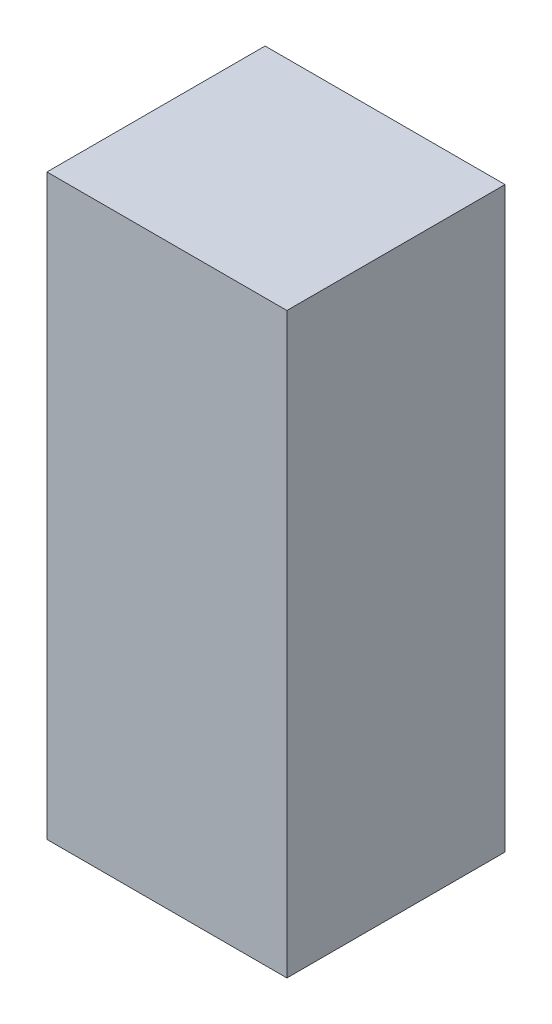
from build123d import *

# Parameters (mm, degrees)
ESQUISSE1_W      = 2.2
ESQUISSE1_H      = 5.3
EXTRUSION1_DEPTH = 2


with BuildPart() as part:
    # Esquisse1 → Extrusion1 (new body)
    with BuildSketch(Plane.XY):
        with Locations((42.046509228, -58.071286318)):
            Rectangle(ESQUISSE1_W, ESQUISSE1_H)
    extrude(amount=EXTRUSION1_DEPTH)


solid = part.part
